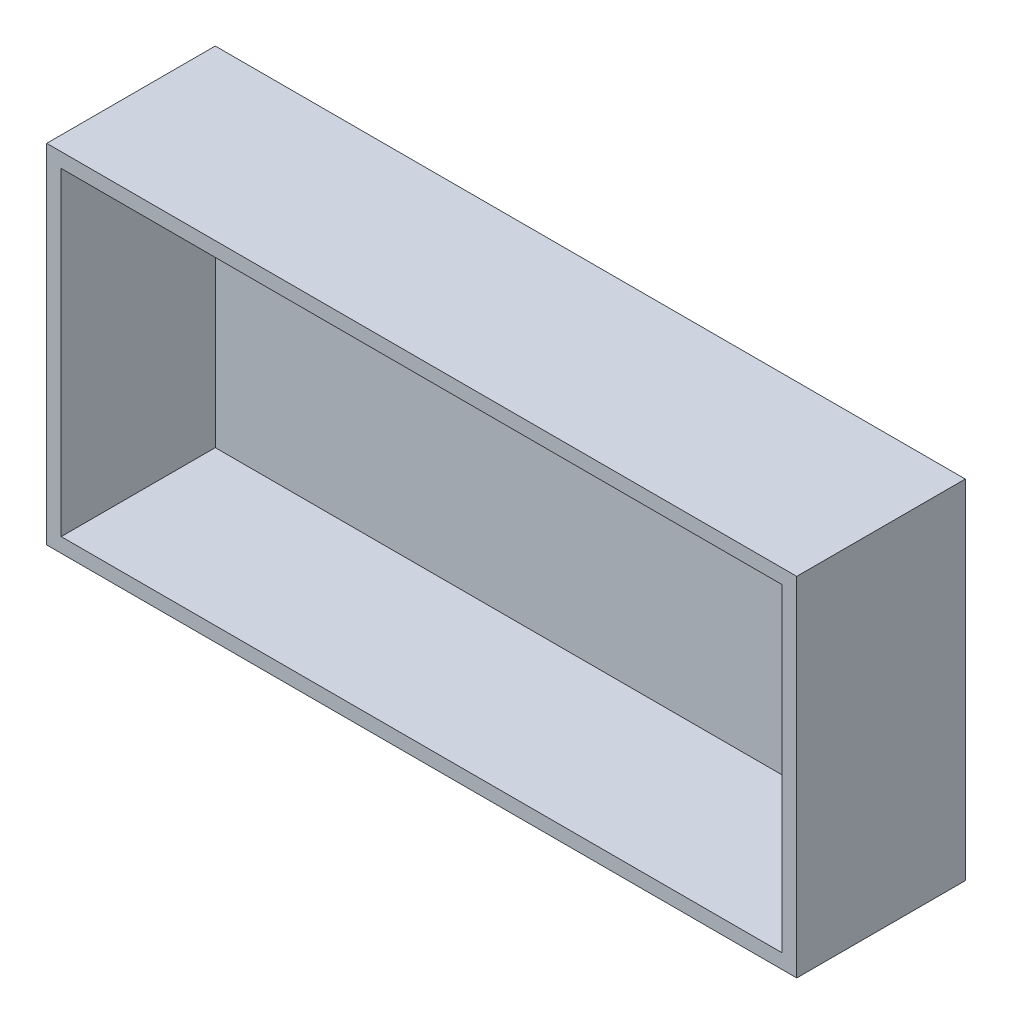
ISO-10303-21;
HEADER;
FILE_DESCRIPTION(('STEP AP214'),'2;1');
FILE_NAME('part.step','',(''),(''),'','','');
FILE_SCHEMA(('AUTOMOTIVE_DESIGN { 1 0 10303 214 1 1 1 1 }'));
ENDSEC;
DATA;
#1=APPLICATION_CONTEXT('core data for automotive mechanical design processes');
#2=APPLICATION_PROTOCOL_DEFINITION('international standard','automotive_design',2000,#1);
#3=PRODUCT_CONTEXT('',#1,'mechanical');
#4=PRODUCT('Part','Part','',(#3));
#5=PRODUCT_RELATED_PRODUCT_CATEGORY('part','',(#4));
#6=PRODUCT_DEFINITION_FORMATION('','',#4);
#7=PRODUCT_DEFINITION_CONTEXT('part definition',#1,'design');
#8=PRODUCT_DEFINITION('design','',#6,#7);
#9=PRODUCT_DEFINITION_SHAPE('','',#8);
#10=(LENGTH_UNIT() NAMED_UNIT(*) SI_UNIT(.MILLI.,.METRE.));
#11=(NAMED_UNIT(*) PLANE_ANGLE_UNIT() SI_UNIT($,.RADIAN.));
#12=(NAMED_UNIT(*) SI_UNIT($,.STERADIAN.) SOLID_ANGLE_UNIT());
#13=UNCERTAINTY_MEASURE_WITH_UNIT(LENGTH_MEASURE(1.E-05),#10,'distance_accuracy_value','');
#14=(GEOMETRIC_REPRESENTATION_CONTEXT(3) GLOBAL_UNCERTAINTY_ASSIGNED_CONTEXT((#13)) GLOBAL_UNIT_ASSIGNED_CONTEXT((#10,
#11,#12)) REPRESENTATION_CONTEXT('',''));
#15=CARTESIAN_POINT('',(0.,0.,0.));
#16=DIRECTION('',(0.,0.,1.));
#17=DIRECTION('',(1.,0.,0.));
#18=AXIS2_PLACEMENT_3D('',#15,#16,#17);
#19=CARTESIAN_POINT('',(25.875,-12.,11.63));
#20=DIRECTION('',(-1.,0.,0.));
#21=DIRECTION('',(0.,0.,1.));
#22=AXIS2_PLACEMENT_3D('',#19,#20,#21);
#23=PLANE('',#22);
#24=DIRECTION('',(0.,1.,0.));
#25=VECTOR('',#24,1.);
#26=CARTESIAN_POINT('',(25.875,-12.,0.));
#27=LINE('',#26,#25);
#28=CARTESIAN_POINT('',(25.875,-12.,0.));
#29=VERTEX_POINT('',#28);
#30=CARTESIAN_POINT('',(25.875,12.,0.));
#31=VERTEX_POINT('',#30);
#32=EDGE_CURVE('E151',#29,#31,#27,.T.);
#33=ORIENTED_EDGE('',*,*,#32,.T.);
#34=DIRECTION('',(0.,0.,-1.));
#35=VECTOR('',#34,1.);
#36=CARTESIAN_POINT('',(25.875,12.,11.63));
#37=LINE('',#36,#35);
#38=CARTESIAN_POINT('',(25.875,12.,11.63));
#39=VERTEX_POINT('',#38);
#40=EDGE_CURVE('E12',#39,#31,#37,.T.);
#41=ORIENTED_EDGE('',*,*,#40,.F.);
#42=DIRECTION('',(0.,1.,0.));
#43=VECTOR('',#42,1.);
#44=CARTESIAN_POINT('',(25.875,-12.,11.63));
#45=LINE('',#44,#43);
#46=CARTESIAN_POINT('',(25.875,-12.,11.63));
#47=VERTEX_POINT('',#46);
#48=EDGE_CURVE('E152',#47,#39,#45,.T.);
#49=ORIENTED_EDGE('',*,*,#48,.F.);
#50=DIRECTION('',(0.,0.,-1.));
#51=VECTOR('',#50,1.);
#52=CARTESIAN_POINT('',(25.875,-12.,11.63));
#53=LINE('',#52,#51);
#54=EDGE_CURVE('E158',#47,#29,#53,.T.);
#55=ORIENTED_EDGE('',*,*,#54,.T.);
#56=EDGE_LOOP('',(#33,#41,#49,#55));
#57=FACE_BOUND('',#56,.T.);
#58=ADVANCED_FACE('F40',(#57),#23,.F.);
#59=CARTESIAN_POINT('',(-25.875,12.,11.63));
#60=DIRECTION('',(0.,-1.,0.));
#61=DIRECTION('',(0.,0.,-1.));
#62=AXIS2_PLACEMENT_3D('',#59,#60,#61);
#63=PLANE('',#62);
#64=DIRECTION('',(-1.,0.,0.));
#65=VECTOR('',#64,1.);
#66=CARTESIAN_POINT('',(-25.875,12.,0.));
#67=LINE('',#66,#65);
#68=CARTESIAN_POINT('',(-25.875,12.,0.));
#69=VERTEX_POINT('',#68);
#70=EDGE_CURVE('E161',#31,#69,#67,.T.);
#71=ORIENTED_EDGE('',*,*,#70,.T.);
#72=DIRECTION('',(0.,0.,-1.));
#73=VECTOR('',#72,1.);
#74=CARTESIAN_POINT('',(-25.875,12.,11.63));
#75=LINE('',#74,#73);
#76=CARTESIAN_POINT('',(-25.875,12.,11.63));
#77=VERTEX_POINT('',#76);
#78=EDGE_CURVE('E47',#77,#69,#75,.T.);
#79=ORIENTED_EDGE('',*,*,#78,.F.);
#80=DIRECTION('',(-1.,0.,0.));
#81=VECTOR('',#80,1.);
#82=CARTESIAN_POINT('',(-25.875,12.,11.63));
#83=LINE('',#82,#81);
#84=EDGE_CURVE('E91',#39,#77,#83,.T.);
#85=ORIENTED_EDGE('',*,*,#84,.F.);
#86=ORIENTED_EDGE('',*,*,#40,.T.);
#87=EDGE_LOOP('',(#71,#79,#85,#86));
#88=FACE_BOUND('',#87,.T.);
#89=ADVANCED_FACE('F190',(#88),#63,.F.);
#90=CARTESIAN_POINT('',(-25.875,-12.,11.63));
#91=DIRECTION('',(1.,0.,0.));
#92=DIRECTION('',(0.,0.,-1.));
#93=AXIS2_PLACEMENT_3D('',#90,#91,#92);
#94=PLANE('',#93);
#95=DIRECTION('',(0.,-1.,0.));
#96=VECTOR('',#95,1.);
#97=CARTESIAN_POINT('',(-25.875,-12.,0.));
#98=LINE('',#97,#96);
#99=CARTESIAN_POINT('',(-25.875,-12.,0.));
#100=VERTEX_POINT('',#99);
#101=EDGE_CURVE('E163',#69,#100,#98,.T.);
#102=ORIENTED_EDGE('',*,*,#101,.T.);
#103=DIRECTION('',(0.,0.,-1.));
#104=VECTOR('',#103,1.);
#105=CARTESIAN_POINT('',(-25.875,-12.,11.63));
#106=LINE('',#105,#104);
#107=CARTESIAN_POINT('',(-25.875,-12.,11.63));
#108=VERTEX_POINT('',#107);
#109=EDGE_CURVE('E167',#108,#100,#106,.T.);
#110=ORIENTED_EDGE('',*,*,#109,.F.);
#111=DIRECTION('',(0.,-1.,0.));
#112=VECTOR('',#111,1.);
#113=CARTESIAN_POINT('',(-25.875,-12.,11.63));
#114=LINE('',#113,#112);
#115=EDGE_CURVE('E155',#77,#108,#114,.T.);
#116=ORIENTED_EDGE('',*,*,#115,.F.);
#117=ORIENTED_EDGE('',*,*,#78,.T.);
#118=EDGE_LOOP('',(#102,#110,#116,#117));
#119=FACE_BOUND('',#118,.T.);
#120=ADVANCED_FACE('F172',(#119),#94,.F.);
#121=CARTESIAN_POINT('',(-25.875,-12.,11.63));
#122=DIRECTION('',(0.,1.,0.));
#123=DIRECTION('',(0.,0.,1.));
#124=AXIS2_PLACEMENT_3D('',#121,#122,#123);
#125=PLANE('',#124);
#126=DIRECTION('',(1.,0.,0.));
#127=VECTOR('',#126,1.);
#128=CARTESIAN_POINT('',(-25.875,-12.,0.));
#129=LINE('',#128,#127);
#130=EDGE_CURVE('E84',#100,#29,#129,.T.);
#131=ORIENTED_EDGE('',*,*,#130,.T.);
#132=ORIENTED_EDGE('',*,*,#54,.F.);
#133=DIRECTION('',(1.,0.,0.));
#134=VECTOR('',#133,1.);
#135=CARTESIAN_POINT('',(-25.875,-12.,11.63));
#136=LINE('',#135,#134);
#137=EDGE_CURVE('E63',#108,#47,#136,.T.);
#138=ORIENTED_EDGE('',*,*,#137,.F.);
#139=ORIENTED_EDGE('',*,*,#109,.T.);
#140=EDGE_LOOP('',(#131,#132,#138,#139));
#141=FACE_BOUND('',#140,.T.);
#142=ADVANCED_FACE('F180',(#141),#125,.F.);
#143=CARTESIAN_POINT('',(0.,0.,11.63));
#144=DIRECTION('',(0.,0.,-1.));
#145=DIRECTION('',(-1.,0.,0.));
#146=AXIS2_PLACEMENT_3D('',#143,#144,#145);
#147=PLANE('',#146);
#148=DIRECTION('',(-1.,0.,0.));
#149=VECTOR('',#148,1.);
#150=CARTESIAN_POINT('',(24.875,11.,11.63));
#151=LINE('',#150,#149);
#152=CARTESIAN_POINT('',(24.875,11.,11.63));
#153=VERTEX_POINT('',#152);
#154=CARTESIAN_POINT('',(-24.875,11.,11.63));
#155=VERTEX_POINT('',#154);
#156=EDGE_CURVE('E137',#153,#155,#151,.T.);
#157=ORIENTED_EDGE('',*,*,#156,.F.);
#158=DIRECTION('',(0.,1.,0.));
#159=VECTOR('',#158,1.);
#160=CARTESIAN_POINT('',(24.875,-11.,11.63));
#161=LINE('',#160,#159);
#162=CARTESIAN_POINT('',(24.875,-11.,11.63));
#163=VERTEX_POINT('',#162);
#164=EDGE_CURVE('E130',#163,#153,#161,.T.);
#165=ORIENTED_EDGE('',*,*,#164,.F.);
#166=DIRECTION('',(1.,0.,0.));
#167=VECTOR('',#166,1.);
#168=CARTESIAN_POINT('',(-24.875,-11.,11.63));
#169=LINE('',#168,#167);
#170=CARTESIAN_POINT('',(-24.875,-11.,11.63));
#171=VERTEX_POINT('',#170);
#172=EDGE_CURVE('E141',#171,#163,#169,.T.);
#173=ORIENTED_EDGE('',*,*,#172,.F.);
#174=DIRECTION('',(0.,-1.,0.));
#175=VECTOR('',#174,1.);
#176=CARTESIAN_POINT('',(-24.875,11.,11.63));
#177=LINE('',#176,#175);
#178=EDGE_CURVE('E54',#155,#171,#177,.T.);
#179=ORIENTED_EDGE('',*,*,#178,.F.);
#180=EDGE_LOOP('',(#157,#165,#173,#179));
#181=FACE_BOUND('',#180,.T.);
#182=ORIENTED_EDGE('',*,*,#48,.T.);
#183=ORIENTED_EDGE('',*,*,#84,.T.);
#184=ORIENTED_EDGE('',*,*,#115,.T.);
#185=ORIENTED_EDGE('',*,*,#137,.T.);
#186=EDGE_LOOP('',(#182,#183,#184,#185));
#187=FACE_BOUND('',#186,.T.);
#188=ADVANCED_FACE('F182',(#181,#187),#147,.F.);
#189=CARTESIAN_POINT('',(0.,0.,0.));
#190=DIRECTION('',(0.,0.,-1.));
#191=DIRECTION('',(-1.,0.,0.));
#192=AXIS2_PLACEMENT_3D('',#189,#190,#191);
#193=PLANE('',#192);
#194=ORIENTED_EDGE('',*,*,#32,.F.);
#195=ORIENTED_EDGE('',*,*,#130,.F.);
#196=ORIENTED_EDGE('',*,*,#101,.F.);
#197=ORIENTED_EDGE('',*,*,#70,.F.);
#198=EDGE_LOOP('',(#194,#195,#196,#197));
#199=FACE_BOUND('',#198,.T.);
#200=ADVANCED_FACE('F176',(#199),#193,.T.);
#201=CARTESIAN_POINT('',(0.,0.,1.));
#202=DIRECTION('',(0.,0.,-1.));
#203=DIRECTION('',(-1.,0.,0.));
#204=AXIS2_PLACEMENT_3D('',#201,#202,#203);
#205=PLANE('',#204);
#206=DIRECTION('',(1.,0.,0.));
#207=VECTOR('',#206,1.);
#208=CARTESIAN_POINT('',(-24.875,-11.,1.));
#209=LINE('',#208,#207);
#210=CARTESIAN_POINT('',(-24.875,-11.,1.));
#211=VERTEX_POINT('',#210);
#212=CARTESIAN_POINT('',(24.875,-11.,1.));
#213=VERTEX_POINT('',#212);
#214=EDGE_CURVE('E134',#211,#213,#209,.T.);
#215=ORIENTED_EDGE('',*,*,#214,.T.);
#216=DIRECTION('',(0.,1.,0.));
#217=VECTOR('',#216,1.);
#218=CARTESIAN_POINT('',(24.875,-11.,1.));
#219=LINE('',#218,#217);
#220=CARTESIAN_POINT('',(24.875,11.,1.));
#221=VERTEX_POINT('',#220);
#222=EDGE_CURVE('E127',#213,#221,#219,.T.);
#223=ORIENTED_EDGE('',*,*,#222,.T.);
#224=DIRECTION('',(-1.,0.,0.));
#225=VECTOR('',#224,1.);
#226=CARTESIAN_POINT('',(24.875,11.,1.));
#227=LINE('',#226,#225);
#228=CARTESIAN_POINT('',(-24.875,11.,1.));
#229=VERTEX_POINT('',#228);
#230=EDGE_CURVE('E114',#221,#229,#227,.T.);
#231=ORIENTED_EDGE('',*,*,#230,.T.);
#232=DIRECTION('',(0.,-1.,0.));
#233=VECTOR('',#232,1.);
#234=CARTESIAN_POINT('',(-24.875,11.,1.));
#235=LINE('',#234,#233);
#236=EDGE_CURVE('E146',#229,#211,#235,.T.);
#237=ORIENTED_EDGE('',*,*,#236,.T.);
#238=EDGE_LOOP('',(#215,#223,#231,#237));
#239=FACE_BOUND('',#238,.T.);
#240=ADVANCED_FACE('F133',(#239),#205,.F.);
#241=CARTESIAN_POINT('',(24.875,-11.,-54.3972655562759));
#242=DIRECTION('',(1.,0.,0.));
#243=DIRECTION('',(0.,0.,-1.));
#244=AXIS2_PLACEMENT_3D('',#241,#242,#243);
#245=PLANE('',#244);
#246=DIRECTION('',(0.,0.,1.));
#247=VECTOR('',#246,1.);
#248=CARTESIAN_POINT('',(24.875,-11.,-54.3972655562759));
#249=LINE('',#248,#247);
#250=EDGE_CURVE('E144',#213,#163,#249,.T.);
#251=ORIENTED_EDGE('',*,*,#250,.T.);
#252=ORIENTED_EDGE('',*,*,#164,.T.);
#253=DIRECTION('',(0.,0.,1.));
#254=VECTOR('',#253,1.);
#255=CARTESIAN_POINT('',(24.875,11.,-54.3972655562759));
#256=LINE('',#255,#254);
#257=EDGE_CURVE('E118',#221,#153,#256,.T.);
#258=ORIENTED_EDGE('',*,*,#257,.F.);
#259=ORIENTED_EDGE('',*,*,#222,.F.);
#260=EDGE_LOOP('',(#251,#252,#258,#259));
#261=FACE_BOUND('',#260,.T.);
#262=ADVANCED_FACE('F126',(#261),#245,.F.);
#263=CARTESIAN_POINT('',(24.875,11.,-54.3972655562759));
#264=DIRECTION('',(0.,1.,0.));
#265=DIRECTION('',(0.,0.,1.));
#266=AXIS2_PLACEMENT_3D('',#263,#264,#265);
#267=PLANE('',#266);
#268=ORIENTED_EDGE('',*,*,#257,.T.);
#269=ORIENTED_EDGE('',*,*,#156,.T.);
#270=DIRECTION('',(0.,0.,1.));
#271=VECTOR('',#270,1.);
#272=CARTESIAN_POINT('',(-24.875,11.,-54.3972655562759));
#273=LINE('',#272,#271);
#274=EDGE_CURVE('E120',#229,#155,#273,.T.);
#275=ORIENTED_EDGE('',*,*,#274,.F.);
#276=ORIENTED_EDGE('',*,*,#230,.F.);
#277=EDGE_LOOP('',(#268,#269,#275,#276));
#278=FACE_BOUND('',#277,.T.);
#279=ADVANCED_FACE('F116',(#278),#267,.F.);
#280=CARTESIAN_POINT('',(-24.875,11.,-54.3972655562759));
#281=DIRECTION('',(-1.,0.,0.));
#282=DIRECTION('',(0.,0.,1.));
#283=AXIS2_PLACEMENT_3D('',#280,#281,#282);
#284=PLANE('',#283);
#285=ORIENTED_EDGE('',*,*,#274,.T.);
#286=ORIENTED_EDGE('',*,*,#178,.T.);
#287=DIRECTION('',(0.,0.,1.));
#288=VECTOR('',#287,1.);
#289=CARTESIAN_POINT('',(-24.875,-11.,-54.3972655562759));
#290=LINE('',#289,#288);
#291=EDGE_CURVE('E145',#211,#171,#290,.T.);
#292=ORIENTED_EDGE('',*,*,#291,.F.);
#293=ORIENTED_EDGE('',*,*,#236,.F.);
#294=EDGE_LOOP('',(#285,#286,#292,#293));
#295=FACE_BOUND('',#294,.T.);
#296=ADVANCED_FACE('F251',(#295),#284,.F.);
#297=CARTESIAN_POINT('',(-24.875,-11.,-54.3972655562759));
#298=DIRECTION('',(0.,-1.,0.));
#299=DIRECTION('',(0.,0.,-1.));
#300=AXIS2_PLACEMENT_3D('',#297,#298,#299);
#301=PLANE('',#300);
#302=ORIENTED_EDGE('',*,*,#291,.T.);
#303=ORIENTED_EDGE('',*,*,#172,.T.);
#304=ORIENTED_EDGE('',*,*,#250,.F.);
#305=ORIENTED_EDGE('',*,*,#214,.F.);
#306=EDGE_LOOP('',(#302,#303,#304,#305));
#307=FACE_BOUND('',#306,.T.);
#308=ADVANCED_FACE('F261',(#307),#301,.F.);
#309=CLOSED_SHELL('',(#58,#89,#120,#142,#188,#200,#240,#262,#279,#296,#308));
#310=MANIFOLD_SOLID_BREP('B2',#309);
#311=ADVANCED_BREP_SHAPE_REPRESENTATION('',(#18,#310),#14);
#312=SHAPE_DEFINITION_REPRESENTATION(#9,#311);
ENDSEC;
END-ISO-10303-21;
